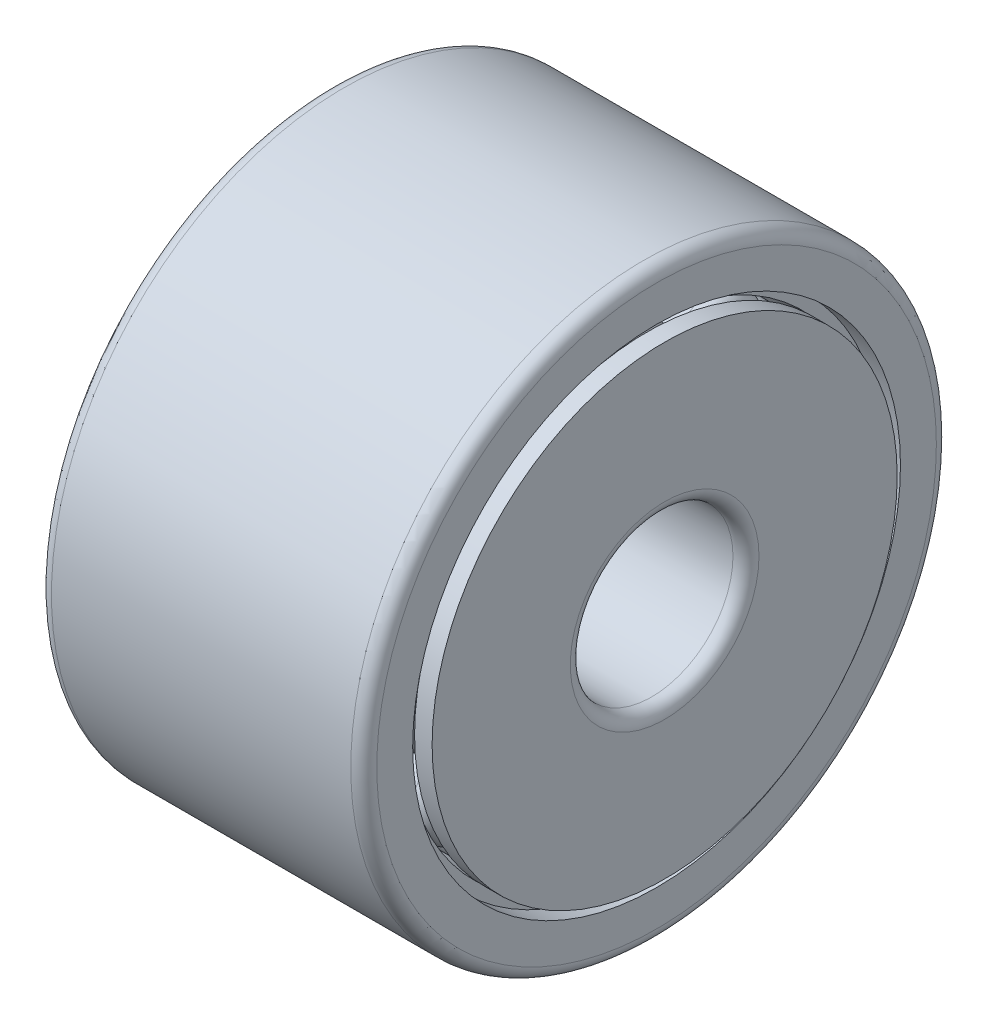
from build123d import *

# Parameters (mm, degrees)
ROLLERSDETAILED_COUNT = 12
ROLLERSDETAILED_ANGLE = 330


with BuildPart() as part:
    # OutRacSke → OuterRace (revolve)
    with BuildSketch(Plane.XY, mode=Mode.PRIVATE) as outerrace_sk:
        with BuildLine():
            Line((-14.022916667, 22.6933125), (-14.022916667, 23.802578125))
            Line((-14.022916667, 23.802578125), (-15.875, 23.802578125))
            Line((-15.875, 23.802578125), (-15.875, 27.305))
            ThreePointArc((-15.875, 27.305), (-15.503025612, 28.203025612), (-14.605, 28.575))
            Line((-14.605, 28.575), (14.605, 28.575))
            ThreePointArc((14.605, 28.575), (15.503025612, 28.203025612), (15.875, 27.305))
            Line((15.875, 27.305), (15.875, 23.802578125))
            Line((15.875, 23.802578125), (14.022916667, 23.802578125))
            Line((14.022916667, 23.802578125), (14.022916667, 22.6933125))
            Line((14.022916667, 22.6933125), (-14.022916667, 22.6933125))
        make_face()
    revolve(outerrace_sk.sketch.rotate(Axis((-7.9375, 0, 0), (1, 0, 0)), 270), axis=Axis((-7.9375, 0, 0), (1, 0, 0)))

    # RolDetSke → RollerDetailed (revolve)
    with BuildSketch(Plane.XY, mode=Mode.PRIVATE) as rollerdetailed_sk:
        with BuildLine():
            Line((-14.022916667, 20.9261075), (-14.022916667, 18.25625))
            Line((-14.022916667, 18.25625), (14.022916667, 18.25625))
            Line((14.022916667, 18.25625), (14.022916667, 20.9261075))
            ThreePointArc((14.022916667, 20.9261075), (13.501594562, 22.184690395), (12.243011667, 22.7060125))
            Line((12.243011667, 22.7060125), (-12.243011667, 22.7060125))
            ThreePointArc((-12.243011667, 22.7060125), (-13.501594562, 22.184690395), (-14.022916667, 20.9261075))
        make_face()
    rollerdetailed = revolve(rollerdetailed_sk.sketch.rotate(Axis((-28.575, 18.25625, 0), (1, 0, 0)), 270), axis=Axis((-28.575, 18.25625, 0), (1, 0, 0)))

    # RollersDetailed: RollerDetailed ×12 about axis
    rollersdetailed_axis = Axis((-50, 0, 0), (1, 0, 0))
    for i in range(1, ROLLERSDETAILED_COUNT):
        add(rollerdetailed.rotate(rollersdetailed_axis, i * ROLLERSDETAILED_ANGLE / (ROLLERSDETAILED_COUNT - 1)))

    # InsRacSke → InnerRace (revolve)
    with BuildSketch(Plane.XY, mode=Mode.PRIVATE) as innerrace_sk:
        with BuildLine():
            Line((-14.948958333, 13.8191875), (-14.948958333, 22.6933125))
            Line((-14.948958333, 22.6933125), (-16.6624, 22.6933125))
            Line((-16.6624, 22.6933125), (-16.6624, 9.2075))
            ThreePointArc((-16.6624, 9.2075), (-16.290425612, 8.309474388), (-15.3924, 7.9375))
            Line((-15.3924, 7.9375), (-0.840026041, 7.9375))
            ThreePointArc((-0.840026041, 7.9375), (0, 8.255), (0.840026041, 7.9375))
            Line((0.840026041, 7.9375), (15.3924, 7.9375))
            ThreePointArc((15.3924, 7.9375), (16.290425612, 8.309474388), (16.6624, 9.2075))
            Line((16.6624, 9.2075), (16.6624, 22.6933125))
            Line((16.6624, 22.6933125), (14.948958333, 22.6933125))
            Line((14.948958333, 22.6933125), (14.948958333, 13.8191875))
            Line((14.948958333, 13.8191875), (-14.948958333, 13.8191875))
        make_face()
    revolve(innerrace_sk.sketch.rotate(Axis((-7.9375, 0, 0), (1, 0, 0)), 270), axis=Axis((-7.9375, 0, 0), (1, 0, 0)))


solid = part.part
